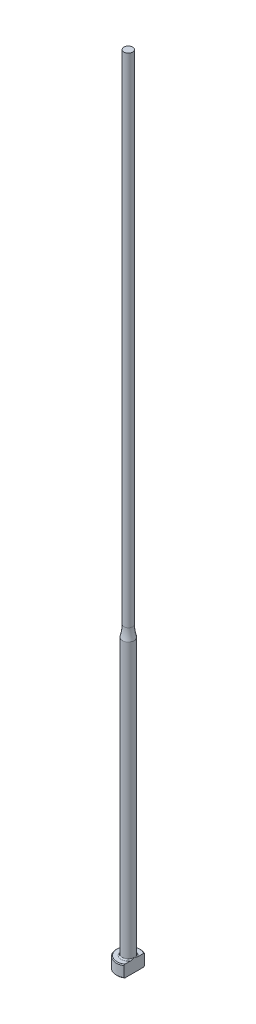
from build123d import *
from build123d.topology import SkipClean

# Parameters (mm, degrees)
CHAMFER1_SIZE = 0.2
FILLET1_R     = 0.3
KEY_DEPTH     = 201.044994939


with BuildPart() as part:
    # Sketch1 → Revolve1 (revolve)
    with BuildSketch(Plane.XY, mode=Mode.PRIVATE) as revolve1_sk:
        with BuildLine():
            Line((0, 0), (-3, 0))
            Line((-3, 0), (-3, 3))
            Line((-3, 3), (-1.5, 3))
            Line((-1.5, 3), (-1.5, 72.2))
            ThreePointArc((-1.5, 72.2), (-1.200505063, 73.585786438), (-1.1, 75))
            Line((-1.1, 75), (-1.1, 200))
            Line((-1.1, 200), (0, 200))
            Line((0, 200), (0, 0))
        make_face()
    revolve(revolve1_sk.sketch.rotate(Axis((0, 259.958771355, 0), (0, -1, 0)), 270), axis=Axis((0, 259.958771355, 0), (0, -1, 0)))

    # Chamfer1
    chamfer1_edges = [part.edges().sort_by_distance(p)[0] for p in [
        (0, 0, -3),
        (0, 3, -3),
    ]]
    chamfer(chamfer1_edges, length=CHAMFER1_SIZE)

    # Fillet1
    fillet1_edges = [part.edges().sort_by_distance(p)[0] for p in [
        (0, 3, -1.5),
    ]]
    fillet(fillet1_edges, radius=FILLET1_R)

    # Sketch2 → KEY (cut, through all)
    with SkipClean():  # the faces are left unmerged after this step: merging them gives an invalid solid
        with BuildSketch(Plane(origin=(0, 0, 0), x_dir=(1, 0, 0), z_dir=(0, 1, 0))):
            with BuildLine():
                Line((1.5, 2.598076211), (1.5, -2.598076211))
                ThreePointArc((1.5, -2.598076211), (3, 0), (1.5, 2.598076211))
            make_face()
        extrude(amount=KEY_DEPTH, mode=Mode.SUBTRACT)


solid = part.part
